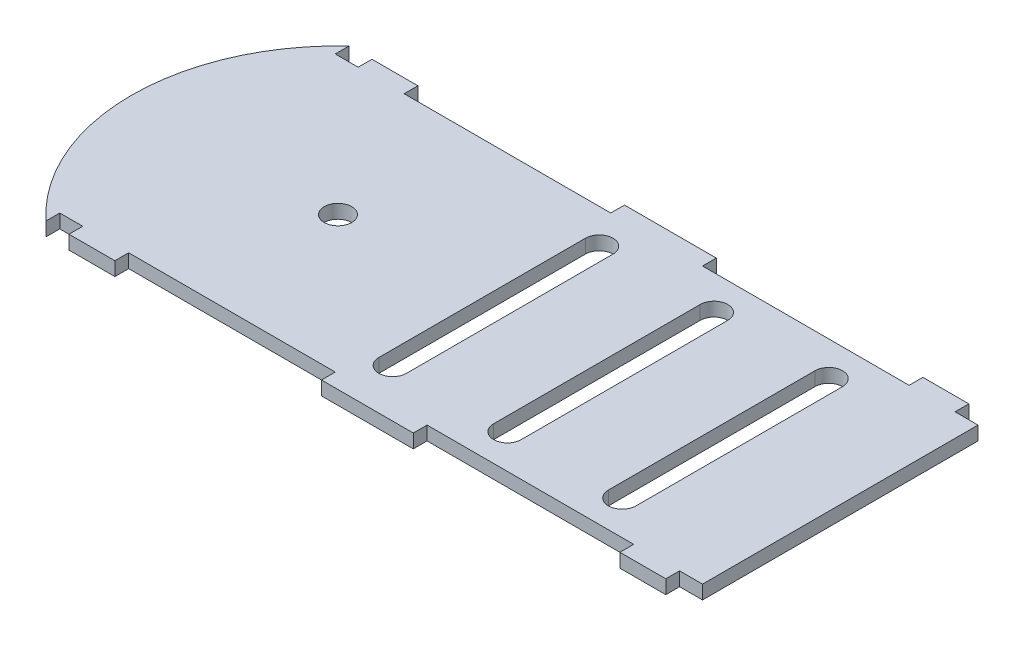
ISO-10303-21;
HEADER;
FILE_DESCRIPTION(('STEP AP214'),'2;1');
FILE_NAME('part.step','',(''),(''),'','','');
FILE_SCHEMA(('AUTOMOTIVE_DESIGN { 1 0 10303 214 1 1 1 1 }'));
ENDSEC;
DATA;
#1=APPLICATION_CONTEXT('core data for automotive mechanical design processes');
#2=APPLICATION_PROTOCOL_DEFINITION('international standard','automotive_design',2000,#1);
#3=PRODUCT_CONTEXT('',#1,'mechanical');
#4=PRODUCT('Part','Part','',(#3));
#5=PRODUCT_RELATED_PRODUCT_CATEGORY('part','',(#4));
#6=PRODUCT_DEFINITION_FORMATION('','',#4);
#7=PRODUCT_DEFINITION_CONTEXT('part definition',#1,'design');
#8=PRODUCT_DEFINITION('design','',#6,#7);
#9=PRODUCT_DEFINITION_SHAPE('','',#8);
#10=(LENGTH_UNIT() NAMED_UNIT(*) SI_UNIT(.MILLI.,.METRE.));
#11=(NAMED_UNIT(*) PLANE_ANGLE_UNIT() SI_UNIT($,.RADIAN.));
#12=(NAMED_UNIT(*) SI_UNIT($,.STERADIAN.) SOLID_ANGLE_UNIT());
#13=UNCERTAINTY_MEASURE_WITH_UNIT(LENGTH_MEASURE(1.E-05),#10,'distance_accuracy_value','');
#14=(GEOMETRIC_REPRESENTATION_CONTEXT(3) GLOBAL_UNCERTAINTY_ASSIGNED_CONTEXT((#13)) GLOBAL_UNIT_ASSIGNED_CONTEXT((#10,
#11,#12)) REPRESENTATION_CONTEXT('',''));
#15=CARTESIAN_POINT('',(0.,0.,0.));
#16=DIRECTION('',(0.,0.,1.));
#17=DIRECTION('',(1.,0.,0.));
#18=AXIS2_PLACEMENT_3D('',#15,#16,#17);
#19=CARTESIAN_POINT('',(-39.4058829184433,3.,0.));
#20=DIRECTION('',(0.,1.,0.));
#21=DIRECTION('',(0.,0.,1.));
#22=AXIS2_PLACEMENT_3D('',#19,#20,#21);
#23=PLANE('',#22);
#24=DIRECTION('',(0.,0.,1.));
#25=VECTOR('',#24,1.);
#26=CARTESIAN_POINT('',(-2.,3.,0.));
#27=LINE('',#26,#25);
#28=CARTESIAN_POINT('',(-2.,3.,-22.4999999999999));
#29=VERTEX_POINT('',#28);
#30=CARTESIAN_POINT('',(-2.,3.,22.5000000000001));
#31=VERTEX_POINT('',#30);
#32=EDGE_CURVE('E341',#29,#31,#27,.T.);
#33=ORIENTED_EDGE('',*,*,#32,.T.);
#34=CARTESIAN_POINT('',(-5.,3.,22.5000000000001));
#35=DIRECTION('',(0.,1.,0.));
#36=DIRECTION('',(0.,0.,1.));
#37=AXIS2_PLACEMENT_3D('',#34,#35,#36);
#38=CIRCLE('',#37,3.);
#39=CARTESIAN_POINT('',(-8.00000000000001,3.,22.5000000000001));
#40=VERTEX_POINT('',#39);
#41=EDGE_CURVE('E304',#31,#40,#38,.F.);
#42=ORIENTED_EDGE('',*,*,#41,.T.);
#43=DIRECTION('',(0.,0.,-1.));
#44=VECTOR('',#43,1.);
#45=CARTESIAN_POINT('',(-8.00000000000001,3.,0.));
#46=LINE('',#45,#44);
#47=CARTESIAN_POINT('',(-8.00000000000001,3.,-22.4999999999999));
#48=VERTEX_POINT('',#47);
#49=EDGE_CURVE('E307',#40,#48,#46,.T.);
#50=ORIENTED_EDGE('',*,*,#49,.T.);
#51=CARTESIAN_POINT('',(-5.,3.,-22.4999999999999));
#52=DIRECTION('',(0.,1.,0.));
#53=DIRECTION('',(0.,0.,1.));
#54=AXIS2_PLACEMENT_3D('',#51,#52,#53);
#55=CIRCLE('',#54,3.);
#56=EDGE_CURVE('E338',#48,#29,#55,.F.);
#57=ORIENTED_EDGE('',*,*,#56,.T.);
#58=EDGE_LOOP('',(#33,#42,#50,#57));
#59=FACE_BOUND('',#58,.T.);
#60=DIRECTION('',(0.,0.,1.));
#61=VECTOR('',#60,1.);
#62=CARTESIAN_POINT('',(48.,3.,0.));
#63=LINE('',#62,#61);
#64=CARTESIAN_POINT('',(48.,3.,-22.5));
#65=VERTEX_POINT('',#64);
#66=CARTESIAN_POINT('',(48.,3.,22.5));
#67=VERTEX_POINT('',#66);
#68=EDGE_CURVE('E404',#65,#67,#63,.T.);
#69=ORIENTED_EDGE('',*,*,#68,.T.);
#70=CARTESIAN_POINT('',(45.,3.,22.5));
#71=DIRECTION('',(0.,1.,0.));
#72=DIRECTION('',(0.,0.,1.));
#73=AXIS2_PLACEMENT_3D('',#70,#71,#72);
#74=CIRCLE('',#73,3.);
#75=CARTESIAN_POINT('',(42.,3.,22.5));
#76=VERTEX_POINT('',#75);
#77=EDGE_CURVE('E407',#67,#76,#74,.F.);
#78=ORIENTED_EDGE('',*,*,#77,.T.);
#79=DIRECTION('',(0.,0.,-1.));
#80=VECTOR('',#79,1.);
#81=CARTESIAN_POINT('',(42.,3.,0.));
#82=LINE('',#81,#80);
#83=CARTESIAN_POINT('',(42.,3.,-22.5));
#84=VERTEX_POINT('',#83);
#85=EDGE_CURVE('E398',#76,#84,#82,.T.);
#86=ORIENTED_EDGE('',*,*,#85,.T.);
#87=CARTESIAN_POINT('',(45.,3.,-22.5));
#88=DIRECTION('',(0.,1.,0.));
#89=DIRECTION('',(0.,0.,1.));
#90=AXIS2_PLACEMENT_3D('',#87,#88,#89);
#91=CIRCLE('',#90,3.);
#92=EDGE_CURVE('E401',#84,#65,#91,.F.);
#93=ORIENTED_EDGE('',*,*,#92,.T.);
#94=EDGE_LOOP('',(#69,#78,#86,#93));
#95=FACE_BOUND('',#94,.T.);
#96=DIRECTION('',(0.,0.,-1.));
#97=VECTOR('',#96,1.);
#98=CARTESIAN_POINT('',(70.,3.,-30.));
#99=LINE('',#98,#97);
#100=CARTESIAN_POINT('',(70.,3.,30.));
#101=VERTEX_POINT('',#100);
#102=CARTESIAN_POINT('',(70.,3.,-30.));
#103=VERTEX_POINT('',#102);
#104=EDGE_CURVE('E577',#101,#103,#99,.T.);
#105=ORIENTED_EDGE('',*,*,#104,.T.);
#106=DIRECTION('',(-1.,0.,0.));
#107=VECTOR('',#106,1.);
#108=CARTESIAN_POINT('',(-70.,3.,-30.));
#109=LINE('',#108,#107);
#110=CARTESIAN_POINT('',(65.,3.,-30.));
#111=VERTEX_POINT('',#110);
#112=EDGE_CURVE('E582',#103,#111,#109,.T.);
#113=ORIENTED_EDGE('',*,*,#112,.T.);
#114=DIRECTION('',(0.,0.,-1.));
#115=VECTOR('',#114,1.);
#116=CARTESIAN_POINT('',(65.,3.,-33.));
#117=LINE('',#116,#115);
#118=CARTESIAN_POINT('',(65.,3.,-33.));
#119=VERTEX_POINT('',#118);
#120=EDGE_CURVE('E521',#111,#119,#117,.T.);
#121=ORIENTED_EDGE('',*,*,#120,.T.);
#122=DIRECTION('',(-1.,0.,0.));
#123=VECTOR('',#122,1.);
#124=CARTESIAN_POINT('',(65.,3.,-33.));
#125=LINE('',#124,#123);
#126=CARTESIAN_POINT('',(55.,3.,-33.));
#127=VERTEX_POINT('',#126);
#128=EDGE_CURVE('E524',#119,#127,#125,.T.);
#129=ORIENTED_EDGE('',*,*,#128,.T.);
#130=DIRECTION('',(0.,0.,1.));
#131=VECTOR('',#130,1.);
#132=CARTESIAN_POINT('',(55.,3.,-33.));
#133=LINE('',#132,#131);
#134=CARTESIAN_POINT('',(55.,3.,-30.));
#135=VERTEX_POINT('',#134);
#136=EDGE_CURVE('E527',#127,#135,#133,.T.);
#137=ORIENTED_EDGE('',*,*,#136,.T.);
#138=CARTESIAN_POINT('',(10.,3.,-30.));
#139=VERTEX_POINT('',#138);
#140=EDGE_CURVE('E586',#135,#139,#109,.T.);
#141=ORIENTED_EDGE('',*,*,#140,.T.);
#142=DIRECTION('',(0.,0.,-1.));
#143=VECTOR('',#142,1.);
#144=CARTESIAN_POINT('',(10.,3.,-33.));
#145=LINE('',#144,#143);
#146=CARTESIAN_POINT('',(10.,3.,-33.));
#147=VERTEX_POINT('',#146);
#148=EDGE_CURVE('E439',#139,#147,#145,.T.);
#149=ORIENTED_EDGE('',*,*,#148,.T.);
#150=DIRECTION('',(-1.,0.,0.));
#151=VECTOR('',#150,1.);
#152=CARTESIAN_POINT('',(-10.,3.,-33.));
#153=LINE('',#152,#151);
#154=CARTESIAN_POINT('',(-10.,3.,-33.));
#155=VERTEX_POINT('',#154);
#156=EDGE_CURVE('E442',#147,#155,#153,.T.);
#157=ORIENTED_EDGE('',*,*,#156,.T.);
#158=DIRECTION('',(0.,0.,1.));
#159=VECTOR('',#158,1.);
#160=CARTESIAN_POINT('',(-10.,3.,-33.));
#161=LINE('',#160,#159);
#162=CARTESIAN_POINT('',(-9.99999999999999,3.,-30.));
#163=VERTEX_POINT('',#162);
#164=EDGE_CURVE('E445',#155,#163,#161,.T.);
#165=ORIENTED_EDGE('',*,*,#164,.T.);
#166=CARTESIAN_POINT('',(-55.,3.,-30.));
#167=VERTEX_POINT('',#166);
#168=EDGE_CURVE('E587',#163,#167,#109,.T.);
#169=ORIENTED_EDGE('',*,*,#168,.T.);
#170=DIRECTION('',(0.,0.,-1.));
#171=VECTOR('',#170,1.);
#172=CARTESIAN_POINT('',(-55.,3.,-33.));
#173=LINE('',#172,#171);
#174=CARTESIAN_POINT('',(-55.,3.,-33.));
#175=VERTEX_POINT('',#174);
#176=EDGE_CURVE('E549',#167,#175,#173,.T.);
#177=ORIENTED_EDGE('',*,*,#176,.T.);
#178=DIRECTION('',(-1.,0.,0.));
#179=VECTOR('',#178,1.);
#180=CARTESIAN_POINT('',(-65.,3.,-33.));
#181=LINE('',#180,#179);
#182=CARTESIAN_POINT('',(-65.,3.,-33.));
#183=VERTEX_POINT('',#182);
#184=EDGE_CURVE('E552',#175,#183,#181,.T.);
#185=ORIENTED_EDGE('',*,*,#184,.T.);
#186=DIRECTION('',(0.,0.,1.));
#187=VECTOR('',#186,1.);
#188=CARTESIAN_POINT('',(-65.,3.,-33.));
#189=LINE('',#188,#187);
#190=CARTESIAN_POINT('',(-65.,3.,-30.));
#191=VERTEX_POINT('',#190);
#192=EDGE_CURVE('E555',#183,#191,#189,.T.);
#193=ORIENTED_EDGE('',*,*,#192,.T.);
#194=CARTESIAN_POINT('',(-70.,3.,-30.));
#195=VERTEX_POINT('',#194);
#196=EDGE_CURVE('E580',#191,#195,#109,.T.);
#197=ORIENTED_EDGE('',*,*,#196,.T.);
#198=DIRECTION('',(0.,0.,-1.));
#199=VECTOR('',#198,1.);
#200=CARTESIAN_POINT('',(-70.,3.,-33.));
#201=LINE('',#200,#199);
#202=CARTESIAN_POINT('',(-70.,3.,-33.));
#203=VERTEX_POINT('',#202);
#204=EDGE_CURVE('E585',#195,#203,#201,.T.);
#205=ORIENTED_EDGE('',*,*,#204,.T.);
#206=CARTESIAN_POINT('',(-39.4058829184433,3.,0.));
#207=DIRECTION('',(0.,1.,0.));
#208=DIRECTION('',(0.,0.,1.));
#209=AXIS2_PLACEMENT_3D('',#206,#207,#208);
#210=CIRCLE('',#209,45.);
#211=CARTESIAN_POINT('',(-70.,3.,33.));
#212=VERTEX_POINT('',#211);
#213=EDGE_CURVE('E589',#203,#212,#210,.T.);
#214=ORIENTED_EDGE('',*,*,#213,.T.);
#215=DIRECTION('',(0.,0.,-1.));
#216=VECTOR('',#215,1.);
#217=CARTESIAN_POINT('',(-70.,3.,30.));
#218=LINE('',#217,#216);
#219=CARTESIAN_POINT('',(-70.,3.,30.));
#220=VERTEX_POINT('',#219);
#221=EDGE_CURVE('E591',#212,#220,#218,.T.);
#222=ORIENTED_EDGE('',*,*,#221,.T.);
#223=DIRECTION('',(1.,0.,0.));
#224=VECTOR('',#223,1.);
#225=CARTESIAN_POINT('',(-70.,3.,30.));
#226=LINE('',#225,#224);
#227=CARTESIAN_POINT('',(-65.,3.,30.));
#228=VERTEX_POINT('',#227);
#229=EDGE_CURVE('E594',#220,#228,#226,.T.);
#230=ORIENTED_EDGE('',*,*,#229,.T.);
#231=DIRECTION('',(0.,0.,1.));
#232=VECTOR('',#231,1.);
#233=CARTESIAN_POINT('',(-65.,3.,33.));
#234=LINE('',#233,#232);
#235=CARTESIAN_POINT('',(-65.,3.,33.));
#236=VERTEX_POINT('',#235);
#237=EDGE_CURVE('E467',#228,#236,#234,.T.);
#238=ORIENTED_EDGE('',*,*,#237,.T.);
#239=DIRECTION('',(1.,0.,0.));
#240=VECTOR('',#239,1.);
#241=CARTESIAN_POINT('',(-65.,3.,33.));
#242=LINE('',#241,#240);
#243=CARTESIAN_POINT('',(-55.,3.,33.));
#244=VERTEX_POINT('',#243);
#245=EDGE_CURVE('E470',#236,#244,#242,.T.);
#246=ORIENTED_EDGE('',*,*,#245,.T.);
#247=DIRECTION('',(0.,0.,-1.));
#248=VECTOR('',#247,1.);
#249=CARTESIAN_POINT('',(-55.,3.,33.));
#250=LINE('',#249,#248);
#251=CARTESIAN_POINT('',(-55.,3.,30.));
#252=VERTEX_POINT('',#251);
#253=EDGE_CURVE('E473',#244,#252,#250,.T.);
#254=ORIENTED_EDGE('',*,*,#253,.T.);
#255=CARTESIAN_POINT('',(-9.99999999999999,3.,30.));
#256=VERTEX_POINT('',#255);
#257=EDGE_CURVE('E598',#252,#256,#226,.T.);
#258=ORIENTED_EDGE('',*,*,#257,.T.);
#259=DIRECTION('',(0.,0.,1.));
#260=VECTOR('',#259,1.);
#261=CARTESIAN_POINT('',(-10.,3.,33.));
#262=LINE('',#261,#260);
#263=CARTESIAN_POINT('',(-10.,3.,33.));
#264=VERTEX_POINT('',#263);
#265=EDGE_CURVE('E411',#256,#264,#262,.T.);
#266=ORIENTED_EDGE('',*,*,#265,.T.);
#267=DIRECTION('',(1.,0.,0.));
#268=VECTOR('',#267,1.);
#269=CARTESIAN_POINT('',(-10.,3.,33.));
#270=LINE('',#269,#268);
#271=CARTESIAN_POINT('',(10.,3.,33.));
#272=VERTEX_POINT('',#271);
#273=EDGE_CURVE('E414',#264,#272,#270,.T.);
#274=ORIENTED_EDGE('',*,*,#273,.T.);
#275=DIRECTION('',(0.,0.,-1.));
#276=VECTOR('',#275,1.);
#277=CARTESIAN_POINT('',(10.,3.,33.));
#278=LINE('',#277,#276);
#279=CARTESIAN_POINT('',(10.,3.,30.));
#280=VERTEX_POINT('',#279);
#281=EDGE_CURVE('E417',#272,#280,#278,.T.);
#282=ORIENTED_EDGE('',*,*,#281,.T.);
#283=CARTESIAN_POINT('',(55.,3.,30.));
#284=VERTEX_POINT('',#283);
#285=EDGE_CURVE('E599',#280,#284,#226,.T.);
#286=ORIENTED_EDGE('',*,*,#285,.T.);
#287=DIRECTION('',(0.,0.,1.));
#288=VECTOR('',#287,1.);
#289=CARTESIAN_POINT('',(55.,3.,33.));
#290=LINE('',#289,#288);
#291=CARTESIAN_POINT('',(55.,3.,33.));
#292=VERTEX_POINT('',#291);
#293=EDGE_CURVE('E498',#284,#292,#290,.T.);
#294=ORIENTED_EDGE('',*,*,#293,.T.);
#295=DIRECTION('',(1.,0.,0.));
#296=VECTOR('',#295,1.);
#297=CARTESIAN_POINT('',(65.,3.,33.));
#298=LINE('',#297,#296);
#299=CARTESIAN_POINT('',(65.,3.,33.));
#300=VERTEX_POINT('',#299);
#301=EDGE_CURVE('E501',#292,#300,#298,.T.);
#302=ORIENTED_EDGE('',*,*,#301,.T.);
#303=DIRECTION('',(0.,0.,-1.));
#304=VECTOR('',#303,1.);
#305=CARTESIAN_POINT('',(65.,3.,33.));
#306=LINE('',#305,#304);
#307=CARTESIAN_POINT('',(65.,3.,30.));
#308=VERTEX_POINT('',#307);
#309=EDGE_CURVE('E495',#300,#308,#306,.T.);
#310=ORIENTED_EDGE('',*,*,#309,.T.);
#311=EDGE_CURVE('E593',#308,#101,#226,.T.);
#312=ORIENTED_EDGE('',*,*,#311,.T.);
#313=EDGE_LOOP('',(#105,#113,#121,#129,#137,#141,#149,#157,#165,#169,#177,#185,#193,#197,#205,
#214,#222,#230,#238,#246,#254,#258,#266,#274,#282,#286,#294,#302,#310,#312));
#314=FACE_BOUND('',#313,.T.);
#315=DIRECTION('',(0.,0.,1.));
#316=VECTOR('',#315,1.);
#317=CARTESIAN_POINT('',(23.,3.,0.));
#318=LINE('',#317,#316);
#319=CARTESIAN_POINT('',(23.,3.,-22.5));
#320=VERTEX_POINT('',#319);
#321=CARTESIAN_POINT('',(23.,3.,22.5));
#322=VERTEX_POINT('',#321);
#323=EDGE_CURVE('E371',#320,#322,#318,.T.);
#324=ORIENTED_EDGE('',*,*,#323,.T.);
#325=CARTESIAN_POINT('',(20.,3.,22.5));
#326=DIRECTION('',(0.,1.,0.));
#327=DIRECTION('',(0.,0.,1.));
#328=AXIS2_PLACEMENT_3D('',#325,#326,#327);
#329=CIRCLE('',#328,3.);
#330=CARTESIAN_POINT('',(17.,3.,22.5));
#331=VERTEX_POINT('',#330);
#332=EDGE_CURVE('E374',#322,#331,#329,.F.);
#333=ORIENTED_EDGE('',*,*,#332,.T.);
#334=DIRECTION('',(0.,0.,-1.));
#335=VECTOR('',#334,1.);
#336=CARTESIAN_POINT('',(17.,3.,0.));
#337=LINE('',#336,#335);
#338=CARTESIAN_POINT('',(17.,3.,-22.5));
#339=VERTEX_POINT('',#338);
#340=EDGE_CURVE('E365',#331,#339,#337,.T.);
#341=ORIENTED_EDGE('',*,*,#340,.T.);
#342=CARTESIAN_POINT('',(20.,3.,-22.5));
#343=DIRECTION('',(0.,1.,0.));
#344=DIRECTION('',(0.,0.,1.));
#345=AXIS2_PLACEMENT_3D('',#342,#343,#344);
#346=CIRCLE('',#345,3.);
#347=EDGE_CURVE('E368',#339,#320,#346,.F.);
#348=ORIENTED_EDGE('',*,*,#347,.T.);
#349=EDGE_LOOP('',(#324,#333,#341,#348));
#350=FACE_BOUND('',#349,.T.);
#351=CARTESIAN_POINT('',(-39.4058829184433,3.,0.));
#352=DIRECTION('',(0.,1.,0.));
#353=DIRECTION('',(0.,0.,1.));
#354=AXIS2_PLACEMENT_3D('',#351,#352,#353);
#355=CIRCLE('',#354,3.);
#356=CARTESIAN_POINT('',(-39.4058829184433,3.,2.99999999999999));
#357=VERTEX_POINT('',#356);
#358=EDGE_CURVE('E323',#357,#357,#355,.F.);
#359=ORIENTED_EDGE('',*,*,#358,.T.);
#360=EDGE_LOOP('',(#359));
#361=FACE_BOUND('',#360,.T.);
#362=ADVANCED_FACE('F32',(#59,#95,#314,#350,#361),#23,.T.);
#363=CARTESIAN_POINT('',(-39.4058829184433,0.,0.));
#364=DIRECTION('',(0.,1.,0.));
#365=DIRECTION('',(0.,0.,1.));
#366=AXIS2_PLACEMENT_3D('',#363,#364,#365);
#367=PLANE('',#366);
#368=CARTESIAN_POINT('',(-5.,0.,22.5000000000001));
#369=DIRECTION('',(0.,1.,0.));
#370=DIRECTION('',(0.,0.,1.));
#371=AXIS2_PLACEMENT_3D('',#368,#369,#370);
#372=CIRCLE('',#371,3.);
#373=CARTESIAN_POINT('',(-8.00000000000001,0.,22.5000000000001));
#374=VERTEX_POINT('',#373);
#375=CARTESIAN_POINT('',(-2.,0.,22.5000000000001));
#376=VERTEX_POINT('',#375);
#377=EDGE_CURVE('E55',#374,#376,#372,.T.);
#378=ORIENTED_EDGE('',*,*,#377,.T.);
#379=DIRECTION('',(0.,0.,-1.));
#380=VECTOR('',#379,1.);
#381=CARTESIAN_POINT('',(-2.,0.,22.5000000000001));
#382=LINE('',#381,#380);
#383=CARTESIAN_POINT('',(-2.,0.,-22.4999999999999));
#384=VERTEX_POINT('',#383);
#385=EDGE_CURVE('E311',#376,#384,#382,.T.);
#386=ORIENTED_EDGE('',*,*,#385,.T.);
#387=CARTESIAN_POINT('',(-5.,0.,-22.4999999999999));
#388=DIRECTION('',(0.,1.,0.));
#389=DIRECTION('',(0.,0.,1.));
#390=AXIS2_PLACEMENT_3D('',#387,#388,#389);
#391=CIRCLE('',#390,3.);
#392=CARTESIAN_POINT('',(-8.00000000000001,0.,-22.4999999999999));
#393=VERTEX_POINT('',#392);
#394=EDGE_CURVE('E317',#384,#393,#391,.T.);
#395=ORIENTED_EDGE('',*,*,#394,.T.);
#396=DIRECTION('',(0.,0.,1.));
#397=VECTOR('',#396,1.);
#398=CARTESIAN_POINT('',(-8.00000000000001,0.,22.5000000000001));
#399=LINE('',#398,#397);
#400=EDGE_CURVE('E322',#393,#374,#399,.T.);
#401=ORIENTED_EDGE('',*,*,#400,.T.);
#402=EDGE_LOOP('',(#378,#386,#395,#401));
#403=FACE_BOUND('',#402,.T.);
#404=CARTESIAN_POINT('',(45.,0.,22.5));
#405=DIRECTION('',(0.,1.,0.));
#406=DIRECTION('',(0.,0.,1.));
#407=AXIS2_PLACEMENT_3D('',#404,#405,#406);
#408=CIRCLE('',#407,3.);
#409=CARTESIAN_POINT('',(42.,0.,22.5));
#410=VERTEX_POINT('',#409);
#411=CARTESIAN_POINT('',(48.,0.,22.5));
#412=VERTEX_POINT('',#411);
#413=EDGE_CURVE('E377',#410,#412,#408,.T.);
#414=ORIENTED_EDGE('',*,*,#413,.T.);
#415=DIRECTION('',(0.,0.,-1.));
#416=VECTOR('',#415,1.);
#417=CARTESIAN_POINT('',(48.,0.,22.5));
#418=LINE('',#417,#416);
#419=CARTESIAN_POINT('',(48.,0.,-22.5));
#420=VERTEX_POINT('',#419);
#421=EDGE_CURVE('E380',#412,#420,#418,.T.);
#422=ORIENTED_EDGE('',*,*,#421,.T.);
#423=CARTESIAN_POINT('',(45.,0.,-22.5));
#424=DIRECTION('',(0.,1.,0.));
#425=DIRECTION('',(0.,0.,1.));
#426=AXIS2_PLACEMENT_3D('',#423,#424,#425);
#427=CIRCLE('',#426,3.);
#428=CARTESIAN_POINT('',(42.,0.,-22.5));
#429=VERTEX_POINT('',#428);
#430=EDGE_CURVE('E383',#420,#429,#427,.T.);
#431=ORIENTED_EDGE('',*,*,#430,.T.);
#432=DIRECTION('',(0.,0.,1.));
#433=VECTOR('',#432,1.);
#434=CARTESIAN_POINT('',(42.,0.,22.5));
#435=LINE('',#434,#433);
#436=EDGE_CURVE('E386',#429,#410,#435,.T.);
#437=ORIENTED_EDGE('',*,*,#436,.T.);
#438=EDGE_LOOP('',(#414,#422,#431,#437));
#439=FACE_BOUND('',#438,.T.);
#440=DIRECTION('',(0.,0.,-1.));
#441=VECTOR('',#440,1.);
#442=CARTESIAN_POINT('',(70.,0.,-30.));
#443=LINE('',#442,#441);
#444=CARTESIAN_POINT('',(70.,0.,30.));
#445=VERTEX_POINT('',#444);
#446=CARTESIAN_POINT('',(70.,0.,-30.));
#447=VERTEX_POINT('',#446);
#448=EDGE_CURVE('E576',#445,#447,#443,.T.);
#449=ORIENTED_EDGE('',*,*,#448,.F.);
#450=DIRECTION('',(1.,0.,0.));
#451=VECTOR('',#450,1.);
#452=CARTESIAN_POINT('',(-70.,0.,30.));
#453=LINE('',#452,#451);
#454=CARTESIAN_POINT('',(65.,0.,30.));
#455=VERTEX_POINT('',#454);
#456=EDGE_CURVE('E613',#455,#445,#453,.T.);
#457=ORIENTED_EDGE('',*,*,#456,.F.);
#458=DIRECTION('',(0.,0.,-1.));
#459=VECTOR('',#458,1.);
#460=CARTESIAN_POINT('',(65.,0.,33.));
#461=LINE('',#460,#459);
#462=CARTESIAN_POINT('',(65.,0.,33.));
#463=VERTEX_POINT('',#462);
#464=EDGE_CURVE('E494',#463,#455,#461,.T.);
#465=ORIENTED_EDGE('',*,*,#464,.F.);
#466=DIRECTION('',(1.,0.,0.));
#467=VECTOR('',#466,1.);
#468=CARTESIAN_POINT('',(65.,0.,33.));
#469=LINE('',#468,#467);
#470=CARTESIAN_POINT('',(55.,0.,33.));
#471=VERTEX_POINT('',#470);
#472=EDGE_CURVE('E499',#471,#463,#469,.T.);
#473=ORIENTED_EDGE('',*,*,#472,.F.);
#474=DIRECTION('',(0.,0.,1.));
#475=VECTOR('',#474,1.);
#476=CARTESIAN_POINT('',(55.,0.,33.));
#477=LINE('',#476,#475);
#478=CARTESIAN_POINT('',(55.,0.,30.));
#479=VERTEX_POINT('',#478);
#480=EDGE_CURVE('E506',#479,#471,#477,.T.);
#481=ORIENTED_EDGE('',*,*,#480,.F.);
#482=CARTESIAN_POINT('',(10.,0.,30.));
#483=VERTEX_POINT('',#482);
#484=EDGE_CURVE('E616',#483,#479,#453,.T.);
#485=ORIENTED_EDGE('',*,*,#484,.F.);
#486=DIRECTION('',(0.,0.,-1.));
#487=VECTOR('',#486,1.);
#488=CARTESIAN_POINT('',(10.,0.,33.));
#489=LINE('',#488,#487);
#490=CARTESIAN_POINT('',(10.,0.,33.));
#491=VERTEX_POINT('',#490);
#492=EDGE_CURVE('E415',#491,#483,#489,.T.);
#493=ORIENTED_EDGE('',*,*,#492,.F.);
#494=DIRECTION('',(1.,0.,0.));
#495=VECTOR('',#494,1.);
#496=CARTESIAN_POINT('',(-10.,0.,33.));
#497=LINE('',#496,#495);
#498=CARTESIAN_POINT('',(-10.,0.,33.));
#499=VERTEX_POINT('',#498);
#500=EDGE_CURVE('E423',#499,#491,#497,.T.);
#501=ORIENTED_EDGE('',*,*,#500,.F.);
#502=DIRECTION('',(0.,0.,1.));
#503=VECTOR('',#502,1.);
#504=CARTESIAN_POINT('',(-10.,0.,33.));
#505=LINE('',#504,#503);
#506=CARTESIAN_POINT('',(-9.99999999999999,0.,30.));
#507=VERTEX_POINT('',#506);
#508=EDGE_CURVE('E410',#507,#499,#505,.T.);
#509=ORIENTED_EDGE('',*,*,#508,.F.);
#510=CARTESIAN_POINT('',(-55.,0.,30.));
#511=VERTEX_POINT('',#510);
#512=EDGE_CURVE('E615',#511,#507,#453,.T.);
#513=ORIENTED_EDGE('',*,*,#512,.F.);
#514=DIRECTION('',(0.,0.,-1.));
#515=VECTOR('',#514,1.);
#516=CARTESIAN_POINT('',(-55.,0.,33.));
#517=LINE('',#516,#515);
#518=CARTESIAN_POINT('',(-55.,0.,33.));
#519=VERTEX_POINT('',#518);
#520=EDGE_CURVE('E471',#519,#511,#517,.T.);
#521=ORIENTED_EDGE('',*,*,#520,.F.);
#522=DIRECTION('',(1.,0.,0.));
#523=VECTOR('',#522,1.);
#524=CARTESIAN_POINT('',(-65.,0.,33.));
#525=LINE('',#524,#523);
#526=CARTESIAN_POINT('',(-65.,0.,33.));
#527=VERTEX_POINT('',#526);
#528=EDGE_CURVE('E479',#527,#519,#525,.T.);
#529=ORIENTED_EDGE('',*,*,#528,.F.);
#530=DIRECTION('',(0.,0.,1.));
#531=VECTOR('',#530,1.);
#532=CARTESIAN_POINT('',(-65.,0.,33.));
#533=LINE('',#532,#531);
#534=CARTESIAN_POINT('',(-65.,0.,30.));
#535=VERTEX_POINT('',#534);
#536=EDGE_CURVE('E466',#535,#527,#533,.T.);
#537=ORIENTED_EDGE('',*,*,#536,.F.);
#538=CARTESIAN_POINT('',(-70.,0.,30.));
#539=VERTEX_POINT('',#538);
#540=EDGE_CURVE('E581',#539,#535,#453,.T.);
#541=ORIENTED_EDGE('',*,*,#540,.F.);
#542=DIRECTION('',(0.,0.,-1.));
#543=VECTOR('',#542,1.);
#544=CARTESIAN_POINT('',(-70.,0.,30.));
#545=LINE('',#544,#543);
#546=CARTESIAN_POINT('',(-70.,0.,33.));
#547=VERTEX_POINT('',#546);
#548=EDGE_CURVE('E611',#547,#539,#545,.T.);
#549=ORIENTED_EDGE('',*,*,#548,.F.);
#550=CARTESIAN_POINT('',(-39.4058829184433,0.,0.));
#551=DIRECTION('',(0.,1.,0.));
#552=DIRECTION('',(0.,0.,1.));
#553=AXIS2_PLACEMENT_3D('',#550,#551,#552);
#554=CIRCLE('',#553,45.);
#555=CARTESIAN_POINT('',(-70.,0.,-33.));
#556=VERTEX_POINT('',#555);
#557=EDGE_CURVE('E609',#556,#547,#554,.T.);
#558=ORIENTED_EDGE('',*,*,#557,.F.);
#559=DIRECTION('',(0.,0.,-1.));
#560=VECTOR('',#559,1.);
#561=CARTESIAN_POINT('',(-70.,0.,-33.));
#562=LINE('',#561,#560);
#563=CARTESIAN_POINT('',(-70.,0.,-30.));
#564=VERTEX_POINT('',#563);
#565=EDGE_CURVE('E605',#564,#556,#562,.T.);
#566=ORIENTED_EDGE('',*,*,#565,.F.);
#567=DIRECTION('',(-1.,0.,0.));
#568=VECTOR('',#567,1.);
#569=CARTESIAN_POINT('',(-70.,0.,-30.));
#570=LINE('',#569,#568);
#571=CARTESIAN_POINT('',(-65.,0.,-30.));
#572=VERTEX_POINT('',#571);
#573=EDGE_CURVE('E602',#572,#564,#570,.T.);
#574=ORIENTED_EDGE('',*,*,#573,.F.);
#575=DIRECTION('',(0.,0.,1.));
#576=VECTOR('',#575,1.);
#577=CARTESIAN_POINT('',(-65.,0.,-33.));
#578=LINE('',#577,#576);
#579=CARTESIAN_POINT('',(-65.,0.,-33.));
#580=VERTEX_POINT('',#579);
#581=EDGE_CURVE('E553',#580,#572,#578,.T.);
#582=ORIENTED_EDGE('',*,*,#581,.F.);
#583=DIRECTION('',(-1.,0.,0.));
#584=VECTOR('',#583,1.);
#585=CARTESIAN_POINT('',(-65.,0.,-33.));
#586=LINE('',#585,#584);
#587=CARTESIAN_POINT('',(-55.,0.,-33.));
#588=VERTEX_POINT('',#587);
#589=EDGE_CURVE('E561',#588,#580,#586,.T.);
#590=ORIENTED_EDGE('',*,*,#589,.F.);
#591=DIRECTION('',(0.,0.,-1.));
#592=VECTOR('',#591,1.);
#593=CARTESIAN_POINT('',(-55.,0.,-33.));
#594=LINE('',#593,#592);
#595=CARTESIAN_POINT('',(-55.,0.,-30.));
#596=VERTEX_POINT('',#595);
#597=EDGE_CURVE('E548',#596,#588,#594,.T.);
#598=ORIENTED_EDGE('',*,*,#597,.F.);
#599=CARTESIAN_POINT('',(-10.,0.,-30.));
#600=VERTEX_POINT('',#599);
#601=EDGE_CURVE('E607',#600,#596,#570,.T.);
#602=ORIENTED_EDGE('',*,*,#601,.F.);
#603=DIRECTION('',(0.,0.,1.));
#604=VECTOR('',#603,1.);
#605=CARTESIAN_POINT('',(-10.,0.,-33.));
#606=LINE('',#605,#604);
#607=CARTESIAN_POINT('',(-10.,0.,-33.));
#608=VERTEX_POINT('',#607);
#609=EDGE_CURVE('E443',#608,#600,#606,.T.);
#610=ORIENTED_EDGE('',*,*,#609,.F.);
#611=DIRECTION('',(-1.,0.,0.));
#612=VECTOR('',#611,1.);
#613=CARTESIAN_POINT('',(-10.,0.,-33.));
#614=LINE('',#613,#612);
#615=CARTESIAN_POINT('',(10.,0.,-33.));
#616=VERTEX_POINT('',#615);
#617=EDGE_CURVE('E451',#616,#608,#614,.T.);
#618=ORIENTED_EDGE('',*,*,#617,.F.);
#619=DIRECTION('',(0.,0.,-1.));
#620=VECTOR('',#619,1.);
#621=CARTESIAN_POINT('',(10.,0.,-33.));
#622=LINE('',#621,#620);
#623=CARTESIAN_POINT('',(10.,0.,-30.));
#624=VERTEX_POINT('',#623);
#625=EDGE_CURVE('E438',#624,#616,#622,.T.);
#626=ORIENTED_EDGE('',*,*,#625,.F.);
#627=CARTESIAN_POINT('',(55.,0.,-30.));
#628=VERTEX_POINT('',#627);
#629=EDGE_CURVE('E606',#628,#624,#570,.T.);
#630=ORIENTED_EDGE('',*,*,#629,.F.);
#631=DIRECTION('',(0.,0.,1.));
#632=VECTOR('',#631,1.);
#633=CARTESIAN_POINT('',(55.,0.,-33.));
#634=LINE('',#633,#632);
#635=CARTESIAN_POINT('',(55.,0.,-33.));
#636=VERTEX_POINT('',#635);
#637=EDGE_CURVE('E525',#636,#628,#634,.T.);
#638=ORIENTED_EDGE('',*,*,#637,.F.);
#639=DIRECTION('',(-1.,0.,0.));
#640=VECTOR('',#639,1.);
#641=CARTESIAN_POINT('',(65.,0.,-33.));
#642=LINE('',#641,#640);
#643=CARTESIAN_POINT('',(65.,0.,-33.));
#644=VERTEX_POINT('',#643);
#645=EDGE_CURVE('E533',#644,#636,#642,.T.);
#646=ORIENTED_EDGE('',*,*,#645,.F.);
#647=DIRECTION('',(0.,0.,-1.));
#648=VECTOR('',#647,1.);
#649=CARTESIAN_POINT('',(65.,0.,-33.));
#650=LINE('',#649,#648);
#651=CARTESIAN_POINT('',(65.,0.,-30.));
#652=VERTEX_POINT('',#651);
#653=EDGE_CURVE('E520',#652,#644,#650,.T.);
#654=ORIENTED_EDGE('',*,*,#653,.F.);
#655=EDGE_CURVE('E603',#447,#652,#570,.T.);
#656=ORIENTED_EDGE('',*,*,#655,.F.);
#657=EDGE_LOOP('',(#449,#457,#465,#473,#481,#485,#493,#501,#509,#513,#521,#529,#537,#541,#549,
#558,#566,#574,#582,#590,#598,#602,#610,#618,#626,#630,#638,#646,#654,#656));
#658=FACE_BOUND('',#657,.T.);
#659=CARTESIAN_POINT('',(20.,0.,22.5));
#660=DIRECTION('',(0.,1.,0.));
#661=DIRECTION('',(0.,0.,1.));
#662=AXIS2_PLACEMENT_3D('',#659,#660,#661);
#663=CIRCLE('',#662,3.);
#664=CARTESIAN_POINT('',(17.,0.,22.5));
#665=VERTEX_POINT('',#664);
#666=CARTESIAN_POINT('',(23.,0.,22.5));
#667=VERTEX_POINT('',#666);
#668=EDGE_CURVE('E344',#665,#667,#663,.T.);
#669=ORIENTED_EDGE('',*,*,#668,.T.);
#670=DIRECTION('',(0.,0.,-1.));
#671=VECTOR('',#670,1.);
#672=CARTESIAN_POINT('',(23.,0.,22.5));
#673=LINE('',#672,#671);
#674=CARTESIAN_POINT('',(23.,0.,-22.5));
#675=VERTEX_POINT('',#674);
#676=EDGE_CURVE('E347',#667,#675,#673,.T.);
#677=ORIENTED_EDGE('',*,*,#676,.T.);
#678=CARTESIAN_POINT('',(20.,0.,-22.5));
#679=DIRECTION('',(0.,1.,0.));
#680=DIRECTION('',(0.,0.,1.));
#681=AXIS2_PLACEMENT_3D('',#678,#679,#680);
#682=CIRCLE('',#681,3.);
#683=CARTESIAN_POINT('',(17.,0.,-22.5));
#684=VERTEX_POINT('',#683);
#685=EDGE_CURVE('E350',#675,#684,#682,.T.);
#686=ORIENTED_EDGE('',*,*,#685,.T.);
#687=DIRECTION('',(0.,0.,1.));
#688=VECTOR('',#687,1.);
#689=CARTESIAN_POINT('',(17.,0.,22.5));
#690=LINE('',#689,#688);
#691=EDGE_CURVE('E353',#684,#665,#690,.T.);
#692=ORIENTED_EDGE('',*,*,#691,.T.);
#693=EDGE_LOOP('',(#669,#677,#686,#692));
#694=FACE_BOUND('',#693,.T.);
#695=CARTESIAN_POINT('',(-39.4058829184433,0.,0.));
#696=DIRECTION('',(0.,1.,0.));
#697=DIRECTION('',(0.,0.,1.));
#698=AXIS2_PLACEMENT_3D('',#695,#696,#697);
#699=CIRCLE('',#698,3.);
#700=CARTESIAN_POINT('',(-39.4058829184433,0.,2.99999999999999));
#701=VERTEX_POINT('',#700);
#702=EDGE_CURVE('E326',#701,#701,#699,.T.);
#703=ORIENTED_EDGE('',*,*,#702,.T.);
#704=EDGE_LOOP('',(#703));
#705=FACE_BOUND('',#704,.T.);
#706=ADVANCED_FACE('F320',(#403,#439,#658,#694,#705),#367,.F.);
#707=CARTESIAN_POINT('',(-70.,3.,30.));
#708=DIRECTION('',(0.,0.,-1.));
#709=DIRECTION('',(-1.,0.,0.));
#710=AXIS2_PLACEMENT_3D('',#707,#708,#709);
#711=PLANE('',#710);
#712=DIRECTION('',(0.,-1.,0.));
#713=VECTOR('',#712,1.);
#714=CARTESIAN_POINT('',(-10.,3.,30.));
#715=LINE('',#714,#713);
#716=EDGE_CURVE('E420',#256,#507,#715,.T.);
#717=ORIENTED_EDGE('',*,*,#716,.F.);
#718=ORIENTED_EDGE('',*,*,#257,.F.);
#719=DIRECTION('',(0.,-1.,0.));
#720=VECTOR('',#719,1.);
#721=CARTESIAN_POINT('',(-55.,3.,30.));
#722=LINE('',#721,#720);
#723=EDGE_CURVE('E485',#252,#511,#722,.T.);
#724=ORIENTED_EDGE('',*,*,#723,.T.);
#725=ORIENTED_EDGE('',*,*,#512,.T.);
#726=EDGE_LOOP('',(#717,#718,#724,#725));
#727=FACE_BOUND('',#726,.T.);
#728=ADVANCED_FACE('F710',(#727),#711,.F.);
#729=DIRECTION('',(0.,-1.,0.));
#730=VECTOR('',#729,1.);
#731=CARTESIAN_POINT('',(10.,3.,30.));
#732=LINE('',#731,#730);
#733=EDGE_CURVE('E429',#280,#483,#732,.T.);
#734=ORIENTED_EDGE('',*,*,#733,.T.);
#735=ORIENTED_EDGE('',*,*,#484,.T.);
#736=DIRECTION('',(0.,-1.,0.));
#737=VECTOR('',#736,1.);
#738=CARTESIAN_POINT('',(55.,3.,30.));
#739=LINE('',#738,#737);
#740=EDGE_CURVE('E514',#284,#479,#739,.T.);
#741=ORIENTED_EDGE('',*,*,#740,.F.);
#742=ORIENTED_EDGE('',*,*,#285,.F.);
#743=EDGE_LOOP('',(#734,#735,#741,#742));
#744=FACE_BOUND('',#743,.T.);
#745=ADVANCED_FACE('F740',(#744),#711,.F.);
#746=CARTESIAN_POINT('',(-70.,3.,-30.));
#747=DIRECTION('',(0.,0.,1.));
#748=DIRECTION('',(1.,0.,0.));
#749=AXIS2_PLACEMENT_3D('',#746,#747,#748);
#750=PLANE('',#749);
#751=DIRECTION('',(0.,-1.,0.));
#752=VECTOR('',#751,1.);
#753=CARTESIAN_POINT('',(10.,3.,-30.));
#754=LINE('',#753,#752);
#755=EDGE_CURVE('E448',#139,#624,#754,.T.);
#756=ORIENTED_EDGE('',*,*,#755,.F.);
#757=ORIENTED_EDGE('',*,*,#140,.F.);
#758=DIRECTION('',(0.,-1.,0.));
#759=VECTOR('',#758,1.);
#760=CARTESIAN_POINT('',(55.,3.,-30.));
#761=LINE('',#760,#759);
#762=EDGE_CURVE('E539',#135,#628,#761,.T.);
#763=ORIENTED_EDGE('',*,*,#762,.T.);
#764=ORIENTED_EDGE('',*,*,#629,.T.);
#765=EDGE_LOOP('',(#756,#757,#763,#764));
#766=FACE_BOUND('',#765,.T.);
#767=ADVANCED_FACE('F687',(#766),#750,.F.);
#768=DIRECTION('',(0.,-1.,0.));
#769=VECTOR('',#768,1.);
#770=CARTESIAN_POINT('',(-10.,3.,-30.));
#771=LINE('',#770,#769);
#772=EDGE_CURVE('E457',#163,#600,#771,.T.);
#773=ORIENTED_EDGE('',*,*,#772,.T.);
#774=ORIENTED_EDGE('',*,*,#601,.T.);
#775=DIRECTION('',(0.,-1.,0.));
#776=VECTOR('',#775,1.);
#777=CARTESIAN_POINT('',(-55.,3.,-30.));
#778=LINE('',#777,#776);
#779=EDGE_CURVE('E558',#167,#596,#778,.T.);
#780=ORIENTED_EDGE('',*,*,#779,.F.);
#781=ORIENTED_EDGE('',*,*,#168,.F.);
#782=EDGE_LOOP('',(#773,#774,#780,#781));
#783=FACE_BOUND('',#782,.T.);
#784=ADVANCED_FACE('F675',(#783),#750,.F.);
#785=DIRECTION('',(0.,-1.,0.));
#786=VECTOR('',#785,1.);
#787=CARTESIAN_POINT('',(-65.,3.,30.));
#788=LINE('',#787,#786);
#789=EDGE_CURVE('E476',#228,#535,#788,.T.);
#790=ORIENTED_EDGE('',*,*,#789,.F.);
#791=ORIENTED_EDGE('',*,*,#229,.F.);
#792=DIRECTION('',(0.,-1.,0.));
#793=VECTOR('',#792,1.);
#794=CARTESIAN_POINT('',(-70.,3.,30.));
#795=LINE('',#794,#793);
#796=EDGE_CURVE('E619',#220,#539,#795,.T.);
#797=ORIENTED_EDGE('',*,*,#796,.T.);
#798=ORIENTED_EDGE('',*,*,#540,.T.);
#799=EDGE_LOOP('',(#790,#791,#797,#798));
#800=FACE_BOUND('',#799,.T.);
#801=ADVANCED_FACE('F768',(#800),#711,.F.);
#802=DIRECTION('',(0.,-1.,0.));
#803=VECTOR('',#802,1.);
#804=CARTESIAN_POINT('',(65.,3.,30.));
#805=LINE('',#804,#803);
#806=EDGE_CURVE('E517',#308,#455,#805,.T.);
#807=ORIENTED_EDGE('',*,*,#806,.T.);
#808=ORIENTED_EDGE('',*,*,#456,.T.);
#809=DIRECTION('',(0.,-1.,0.));
#810=VECTOR('',#809,1.);
#811=CARTESIAN_POINT('',(70.,3.,30.));
#812=LINE('',#811,#810);
#813=EDGE_CURVE('E597',#101,#445,#812,.T.);
#814=ORIENTED_EDGE('',*,*,#813,.F.);
#815=ORIENTED_EDGE('',*,*,#311,.F.);
#816=EDGE_LOOP('',(#807,#808,#814,#815));
#817=FACE_BOUND('',#816,.T.);
#818=ADVANCED_FACE('F706',(#817),#711,.F.);
#819=DIRECTION('',(0.,-1.,0.));
#820=VECTOR('',#819,1.);
#821=CARTESIAN_POINT('',(65.,3.,-30.));
#822=LINE('',#821,#820);
#823=EDGE_CURVE('E530',#111,#652,#822,.T.);
#824=ORIENTED_EDGE('',*,*,#823,.F.);
#825=ORIENTED_EDGE('',*,*,#112,.F.);
#826=DIRECTION('',(0.,-1.,0.));
#827=VECTOR('',#826,1.);
#828=CARTESIAN_POINT('',(70.,3.,-30.));
#829=LINE('',#828,#827);
#830=EDGE_CURVE('E11',#103,#447,#829,.T.);
#831=ORIENTED_EDGE('',*,*,#830,.T.);
#832=ORIENTED_EDGE('',*,*,#655,.T.);
#833=EDGE_LOOP('',(#824,#825,#831,#832));
#834=FACE_BOUND('',#833,.T.);
#835=ADVANCED_FACE('F701',(#834),#750,.F.);
#836=DIRECTION('',(0.,-1.,0.));
#837=VECTOR('',#836,1.);
#838=CARTESIAN_POINT('',(-65.,3.,-30.));
#839=LINE('',#838,#837);
#840=EDGE_CURVE('E567',#191,#572,#839,.T.);
#841=ORIENTED_EDGE('',*,*,#840,.T.);
#842=ORIENTED_EDGE('',*,*,#573,.T.);
#843=DIRECTION('',(0.,-1.,0.));
#844=VECTOR('',#843,1.);
#845=CARTESIAN_POINT('',(-70.,3.,-30.));
#846=LINE('',#845,#844);
#847=EDGE_CURVE('E40',#195,#564,#846,.T.);
#848=ORIENTED_EDGE('',*,*,#847,.F.);
#849=ORIENTED_EDGE('',*,*,#196,.F.);
#850=EDGE_LOOP('',(#841,#842,#848,#849));
#851=FACE_BOUND('',#850,.T.);
#852=ADVANCED_FACE('F686',(#851),#750,.F.);
#853=CARTESIAN_POINT('',(70.,3.,-30.));
#854=DIRECTION('',(-1.,0.,0.));
#855=DIRECTION('',(0.,0.,1.));
#856=AXIS2_PLACEMENT_3D('',#853,#854,#855);
#857=PLANE('',#856);
#858=ORIENTED_EDGE('',*,*,#448,.T.);
#859=ORIENTED_EDGE('',*,*,#830,.F.);
#860=ORIENTED_EDGE('',*,*,#104,.F.);
#861=ORIENTED_EDGE('',*,*,#813,.T.);
#862=EDGE_LOOP('',(#858,#859,#860,#861));
#863=FACE_BOUND('',#862,.T.);
#864=ADVANCED_FACE('F34',(#863),#857,.F.);
#865=CARTESIAN_POINT('',(-70.,3.,-33.));
#866=DIRECTION('',(-1.,0.,0.));
#867=DIRECTION('',(0.,0.,1.));
#868=AXIS2_PLACEMENT_3D('',#865,#866,#867);
#869=PLANE('',#868);
#870=ORIENTED_EDGE('',*,*,#565,.T.);
#871=DIRECTION('',(0.,-1.,0.));
#872=VECTOR('',#871,1.);
#873=CARTESIAN_POINT('',(-70.,3.,-33.));
#874=LINE('',#873,#872);
#875=EDGE_CURVE('E625',#203,#556,#874,.T.);
#876=ORIENTED_EDGE('',*,*,#875,.F.);
#877=ORIENTED_EDGE('',*,*,#204,.F.);
#878=ORIENTED_EDGE('',*,*,#847,.T.);
#879=EDGE_LOOP('',(#870,#876,#877,#878));
#880=FACE_BOUND('',#879,.T.);
#881=ADVANCED_FACE('F632',(#880),#869,.F.);
#882=CARTESIAN_POINT('',(-39.4058829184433,3.,0.));
#883=DIRECTION('',(0.,-1.,0.));
#884=DIRECTION('',(0.,0.,-1.));
#885=AXIS2_PLACEMENT_3D('',#882,#883,#884);
#886=CYLINDRICAL_SURFACE('',#885,45.);
#887=ORIENTED_EDGE('',*,*,#557,.T.);
#888=DIRECTION('',(0.,-1.,0.));
#889=VECTOR('',#888,1.);
#890=CARTESIAN_POINT('',(-70.,3.,33.));
#891=LINE('',#890,#889);
#892=EDGE_CURVE('E622',#212,#547,#891,.T.);
#893=ORIENTED_EDGE('',*,*,#892,.F.);
#894=ORIENTED_EDGE('',*,*,#213,.F.);
#895=ORIENTED_EDGE('',*,*,#875,.T.);
#896=EDGE_LOOP('',(#887,#893,#894,#895));
#897=FACE_BOUND('',#896,.T.);
#898=ADVANCED_FACE('F644',(#897),#886,.T.);
#899=CARTESIAN_POINT('',(-70.,3.,30.));
#900=DIRECTION('',(-1.,0.,0.));
#901=DIRECTION('',(0.,0.,1.));
#902=AXIS2_PLACEMENT_3D('',#899,#900,#901);
#903=PLANE('',#902);
#904=ORIENTED_EDGE('',*,*,#548,.T.);
#905=ORIENTED_EDGE('',*,*,#796,.F.);
#906=ORIENTED_EDGE('',*,*,#221,.F.);
#907=ORIENTED_EDGE('',*,*,#892,.T.);
#908=EDGE_LOOP('',(#904,#905,#906,#907));
#909=FACE_BOUND('',#908,.T.);
#910=ADVANCED_FACE('F648',(#909),#903,.F.);
#911=CARTESIAN_POINT('',(-55.,3.,-33.));
#912=DIRECTION('',(-1.,0.,0.));
#913=DIRECTION('',(0.,0.,1.));
#914=AXIS2_PLACEMENT_3D('',#911,#912,#913);
#915=PLANE('',#914);
#916=ORIENTED_EDGE('',*,*,#597,.T.);
#917=DIRECTION('',(0.,-1.,0.));
#918=VECTOR('',#917,1.);
#919=CARTESIAN_POINT('',(-55.,3.,-33.));
#920=LINE('',#919,#918);
#921=EDGE_CURVE('E573',#175,#588,#920,.T.);
#922=ORIENTED_EDGE('',*,*,#921,.F.);
#923=ORIENTED_EDGE('',*,*,#176,.F.);
#924=ORIENTED_EDGE('',*,*,#779,.T.);
#925=EDGE_LOOP('',(#916,#922,#923,#924));
#926=FACE_BOUND('',#925,.T.);
#927=ADVANCED_FACE('F680',(#926),#915,.F.);
#928=CARTESIAN_POINT('',(-65.,3.,-33.));
#929=DIRECTION('',(0.,0.,1.));
#930=DIRECTION('',(1.,0.,0.));
#931=AXIS2_PLACEMENT_3D('',#928,#929,#930);
#932=PLANE('',#931);
#933=ORIENTED_EDGE('',*,*,#589,.T.);
#934=DIRECTION('',(0.,-1.,0.));
#935=VECTOR('',#934,1.);
#936=CARTESIAN_POINT('',(-65.,3.,-33.));
#937=LINE('',#936,#935);
#938=EDGE_CURVE('E570',#183,#580,#937,.T.);
#939=ORIENTED_EDGE('',*,*,#938,.F.);
#940=ORIENTED_EDGE('',*,*,#184,.F.);
#941=ORIENTED_EDGE('',*,*,#921,.T.);
#942=EDGE_LOOP('',(#933,#939,#940,#941));
#943=FACE_BOUND('',#942,.T.);
#944=ADVANCED_FACE('F683',(#943),#932,.F.);
#945=CARTESIAN_POINT('',(-65.,3.,-33.));
#946=DIRECTION('',(1.,0.,0.));
#947=DIRECTION('',(0.,0.,-1.));
#948=AXIS2_PLACEMENT_3D('',#945,#946,#947);
#949=PLANE('',#948);
#950=ORIENTED_EDGE('',*,*,#581,.T.);
#951=ORIENTED_EDGE('',*,*,#840,.F.);
#952=ORIENTED_EDGE('',*,*,#192,.F.);
#953=ORIENTED_EDGE('',*,*,#938,.T.);
#954=EDGE_LOOP('',(#950,#951,#952,#953));
#955=FACE_BOUND('',#954,.T.);
#956=ADVANCED_FACE('F685',(#955),#949,.F.);
#957=CARTESIAN_POINT('',(65.,3.,-33.));
#958=DIRECTION('',(-1.,0.,0.));
#959=DIRECTION('',(0.,0.,1.));
#960=AXIS2_PLACEMENT_3D('',#957,#958,#959);
#961=PLANE('',#960);
#962=ORIENTED_EDGE('',*,*,#653,.T.);
#963=DIRECTION('',(0.,-1.,0.));
#964=VECTOR('',#963,1.);
#965=CARTESIAN_POINT('',(65.,3.,-33.));
#966=LINE('',#965,#964);
#967=EDGE_CURVE('E545',#119,#644,#966,.T.);
#968=ORIENTED_EDGE('',*,*,#967,.F.);
#969=ORIENTED_EDGE('',*,*,#120,.F.);
#970=ORIENTED_EDGE('',*,*,#823,.T.);
#971=EDGE_LOOP('',(#962,#968,#969,#970));
#972=FACE_BOUND('',#971,.T.);
#973=ADVANCED_FACE('F698',(#972),#961,.F.);
#974=CARTESIAN_POINT('',(65.,3.,-33.));
#975=DIRECTION('',(0.,0.,1.));
#976=DIRECTION('',(1.,0.,0.));
#977=AXIS2_PLACEMENT_3D('',#974,#975,#976);
#978=PLANE('',#977);
#979=ORIENTED_EDGE('',*,*,#645,.T.);
#980=DIRECTION('',(0.,-1.,0.));
#981=VECTOR('',#980,1.);
#982=CARTESIAN_POINT('',(55.,3.,-33.));
#983=LINE('',#982,#981);
#984=EDGE_CURVE('E542',#127,#636,#983,.T.);
#985=ORIENTED_EDGE('',*,*,#984,.F.);
#986=ORIENTED_EDGE('',*,*,#128,.F.);
#987=ORIENTED_EDGE('',*,*,#967,.T.);
#988=EDGE_LOOP('',(#979,#985,#986,#987));
#989=FACE_BOUND('',#988,.T.);
#990=ADVANCED_FACE('F694',(#989),#978,.F.);
#991=CARTESIAN_POINT('',(55.,3.,-33.));
#992=DIRECTION('',(1.,0.,0.));
#993=DIRECTION('',(0.,0.,-1.));
#994=AXIS2_PLACEMENT_3D('',#991,#992,#993);
#995=PLANE('',#994);
#996=ORIENTED_EDGE('',*,*,#637,.T.);
#997=ORIENTED_EDGE('',*,*,#762,.F.);
#998=ORIENTED_EDGE('',*,*,#136,.F.);
#999=ORIENTED_EDGE('',*,*,#984,.T.);
#1000=EDGE_LOOP('',(#996,#997,#998,#999));
#1001=FACE_BOUND('',#1000,.T.);
#1002=ADVANCED_FACE('F691',(#1001),#995,.F.);
#1003=CARTESIAN_POINT('',(65.,3.,33.));
#1004=DIRECTION('',(-1.,0.,0.));
#1005=DIRECTION('',(0.,0.,1.));
#1006=AXIS2_PLACEMENT_3D('',#1003,#1004,#1005);
#1007=PLANE('',#1006);
#1008=ORIENTED_EDGE('',*,*,#464,.T.);
#1009=ORIENTED_EDGE('',*,*,#806,.F.);
#1010=ORIENTED_EDGE('',*,*,#309,.F.);
#1011=DIRECTION('',(0.,-1.,0.));
#1012=VECTOR('',#1011,1.);
#1013=CARTESIAN_POINT('',(65.,3.,33.));
#1014=LINE('',#1013,#1012);
#1015=EDGE_CURVE('E503',#300,#463,#1014,.T.);
#1016=ORIENTED_EDGE('',*,*,#1015,.T.);
#1017=EDGE_LOOP('',(#1008,#1009,#1010,#1016));
#1018=FACE_BOUND('',#1017,.T.);
#1019=ADVANCED_FACE('F729',(#1018),#1007,.F.);
#1020=CARTESIAN_POINT('',(55.,3.,33.));
#1021=DIRECTION('',(1.,0.,0.));
#1022=DIRECTION('',(0.,0.,-1.));
#1023=AXIS2_PLACEMENT_3D('',#1020,#1021,#1022);
#1024=PLANE('',#1023);
#1025=ORIENTED_EDGE('',*,*,#480,.T.);
#1026=DIRECTION('',(0.,-1.,0.));
#1027=VECTOR('',#1026,1.);
#1028=CARTESIAN_POINT('',(55.,3.,33.));
#1029=LINE('',#1028,#1027);
#1030=EDGE_CURVE('E511',#292,#471,#1029,.T.);
#1031=ORIENTED_EDGE('',*,*,#1030,.F.);
#1032=ORIENTED_EDGE('',*,*,#293,.F.);
#1033=ORIENTED_EDGE('',*,*,#740,.T.);
#1034=EDGE_LOOP('',(#1025,#1031,#1032,#1033));
#1035=FACE_BOUND('',#1034,.T.);
#1036=ADVANCED_FACE('F737',(#1035),#1024,.F.);
#1037=CARTESIAN_POINT('',(65.,3.,33.));
#1038=DIRECTION('',(0.,0.,-1.));
#1039=DIRECTION('',(-1.,0.,0.));
#1040=AXIS2_PLACEMENT_3D('',#1037,#1038,#1039);
#1041=PLANE('',#1040);
#1042=ORIENTED_EDGE('',*,*,#472,.T.);
#1043=ORIENTED_EDGE('',*,*,#1015,.F.);
#1044=ORIENTED_EDGE('',*,*,#301,.F.);
#1045=ORIENTED_EDGE('',*,*,#1030,.T.);
#1046=EDGE_LOOP('',(#1042,#1043,#1044,#1045));
#1047=FACE_BOUND('',#1046,.T.);
#1048=ADVANCED_FACE('F733',(#1047),#1041,.F.);
#1049=CARTESIAN_POINT('',(-65.,3.,33.));
#1050=DIRECTION('',(1.,0.,0.));
#1051=DIRECTION('',(0.,0.,-1.));
#1052=AXIS2_PLACEMENT_3D('',#1049,#1050,#1051);
#1053=PLANE('',#1052);
#1054=ORIENTED_EDGE('',*,*,#536,.T.);
#1055=DIRECTION('',(0.,-1.,0.));
#1056=VECTOR('',#1055,1.);
#1057=CARTESIAN_POINT('',(-65.,3.,33.));
#1058=LINE('',#1057,#1056);
#1059=EDGE_CURVE('E491',#236,#527,#1058,.T.);
#1060=ORIENTED_EDGE('',*,*,#1059,.F.);
#1061=ORIENTED_EDGE('',*,*,#237,.F.);
#1062=ORIENTED_EDGE('',*,*,#789,.T.);
#1063=EDGE_LOOP('',(#1054,#1060,#1061,#1062));
#1064=FACE_BOUND('',#1063,.T.);
#1065=ADVANCED_FACE('F792',(#1064),#1053,.F.);
#1066=CARTESIAN_POINT('',(-65.,3.,33.));
#1067=DIRECTION('',(0.,0.,-1.));
#1068=DIRECTION('',(-1.,0.,0.));
#1069=AXIS2_PLACEMENT_3D('',#1066,#1067,#1068);
#1070=PLANE('',#1069);
#1071=ORIENTED_EDGE('',*,*,#528,.T.);
#1072=DIRECTION('',(0.,-1.,0.));
#1073=VECTOR('',#1072,1.);
#1074=CARTESIAN_POINT('',(-55.,3.,33.));
#1075=LINE('',#1074,#1073);
#1076=EDGE_CURVE('E488',#244,#519,#1075,.T.);
#1077=ORIENTED_EDGE('',*,*,#1076,.F.);
#1078=ORIENTED_EDGE('',*,*,#245,.F.);
#1079=ORIENTED_EDGE('',*,*,#1059,.T.);
#1080=EDGE_LOOP('',(#1071,#1077,#1078,#1079));
#1081=FACE_BOUND('',#1080,.T.);
#1082=ADVANCED_FACE('F796',(#1081),#1070,.F.);
#1083=CARTESIAN_POINT('',(-55.,3.,33.));
#1084=DIRECTION('',(-1.,0.,0.));
#1085=DIRECTION('',(0.,0.,1.));
#1086=AXIS2_PLACEMENT_3D('',#1083,#1084,#1085);
#1087=PLANE('',#1086);
#1088=ORIENTED_EDGE('',*,*,#520,.T.);
#1089=ORIENTED_EDGE('',*,*,#723,.F.);
#1090=ORIENTED_EDGE('',*,*,#253,.F.);
#1091=ORIENTED_EDGE('',*,*,#1076,.T.);
#1092=EDGE_LOOP('',(#1088,#1089,#1090,#1091));
#1093=FACE_BOUND('',#1092,.T.);
#1094=ADVANCED_FACE('F798',(#1093),#1087,.F.);
#1095=CARTESIAN_POINT('',(10.,3.,-33.));
#1096=DIRECTION('',(-1.,0.,0.));
#1097=DIRECTION('',(0.,0.,1.));
#1098=AXIS2_PLACEMENT_3D('',#1095,#1096,#1097);
#1099=PLANE('',#1098);
#1100=ORIENTED_EDGE('',*,*,#625,.T.);
#1101=DIRECTION('',(0.,-1.,0.));
#1102=VECTOR('',#1101,1.);
#1103=CARTESIAN_POINT('',(10.,3.,-33.));
#1104=LINE('',#1103,#1102);
#1105=EDGE_CURVE('E463',#147,#616,#1104,.T.);
#1106=ORIENTED_EDGE('',*,*,#1105,.F.);
#1107=ORIENTED_EDGE('',*,*,#148,.F.);
#1108=ORIENTED_EDGE('',*,*,#755,.T.);
#1109=EDGE_LOOP('',(#1100,#1106,#1107,#1108));
#1110=FACE_BOUND('',#1109,.T.);
#1111=ADVANCED_FACE('F663',(#1110),#1099,.F.);
#1112=CARTESIAN_POINT('',(-10.,3.,-33.));
#1113=DIRECTION('',(0.,0.,1.));
#1114=DIRECTION('',(1.,0.,0.));
#1115=AXIS2_PLACEMENT_3D('',#1112,#1113,#1114);
#1116=PLANE('',#1115);
#1117=ORIENTED_EDGE('',*,*,#617,.T.);
#1118=DIRECTION('',(0.,-1.,0.));
#1119=VECTOR('',#1118,1.);
#1120=CARTESIAN_POINT('',(-10.,3.,-33.));
#1121=LINE('',#1120,#1119);
#1122=EDGE_CURVE('E460',#155,#608,#1121,.T.);
#1123=ORIENTED_EDGE('',*,*,#1122,.F.);
#1124=ORIENTED_EDGE('',*,*,#156,.F.);
#1125=ORIENTED_EDGE('',*,*,#1105,.T.);
#1126=EDGE_LOOP('',(#1117,#1123,#1124,#1125));
#1127=FACE_BOUND('',#1126,.T.);
#1128=ADVANCED_FACE('F666',(#1127),#1116,.F.);
#1129=CARTESIAN_POINT('',(-10.,3.,-33.));
#1130=DIRECTION('',(1.,0.,0.));
#1131=DIRECTION('',(0.,0.,-1.));
#1132=AXIS2_PLACEMENT_3D('',#1129,#1130,#1131);
#1133=PLANE('',#1132);
#1134=ORIENTED_EDGE('',*,*,#609,.T.);
#1135=ORIENTED_EDGE('',*,*,#772,.F.);
#1136=ORIENTED_EDGE('',*,*,#164,.F.);
#1137=ORIENTED_EDGE('',*,*,#1122,.T.);
#1138=EDGE_LOOP('',(#1134,#1135,#1136,#1137));
#1139=FACE_BOUND('',#1138,.T.);
#1140=ADVANCED_FACE('F672',(#1139),#1133,.F.);
#1141=CARTESIAN_POINT('',(-10.,3.,33.));
#1142=DIRECTION('',(1.,0.,0.));
#1143=DIRECTION('',(0.,0.,-1.));
#1144=AXIS2_PLACEMENT_3D('',#1141,#1142,#1143);
#1145=PLANE('',#1144);
#1146=ORIENTED_EDGE('',*,*,#508,.T.);
#1147=DIRECTION('',(0.,-1.,0.));
#1148=VECTOR('',#1147,1.);
#1149=CARTESIAN_POINT('',(-10.,3.,33.));
#1150=LINE('',#1149,#1148);
#1151=EDGE_CURVE('E435',#264,#499,#1150,.T.);
#1152=ORIENTED_EDGE('',*,*,#1151,.F.);
#1153=ORIENTED_EDGE('',*,*,#265,.F.);
#1154=ORIENTED_EDGE('',*,*,#716,.T.);
#1155=EDGE_LOOP('',(#1146,#1152,#1153,#1154));
#1156=FACE_BOUND('',#1155,.T.);
#1157=ADVANCED_FACE('F717',(#1156),#1145,.F.);
#1158=CARTESIAN_POINT('',(-10.,3.,33.));
#1159=DIRECTION('',(0.,0.,-1.));
#1160=DIRECTION('',(-1.,0.,0.));
#1161=AXIS2_PLACEMENT_3D('',#1158,#1159,#1160);
#1162=PLANE('',#1161);
#1163=ORIENTED_EDGE('',*,*,#500,.T.);
#1164=DIRECTION('',(0.,-1.,0.));
#1165=VECTOR('',#1164,1.);
#1166=CARTESIAN_POINT('',(10.,3.,33.));
#1167=LINE('',#1166,#1165);
#1168=EDGE_CURVE('E432',#272,#491,#1167,.T.);
#1169=ORIENTED_EDGE('',*,*,#1168,.F.);
#1170=ORIENTED_EDGE('',*,*,#273,.F.);
#1171=ORIENTED_EDGE('',*,*,#1151,.T.);
#1172=EDGE_LOOP('',(#1163,#1169,#1170,#1171));
#1173=FACE_BOUND('',#1172,.T.);
#1174=ADVANCED_FACE('F722',(#1173),#1162,.F.);
#1175=CARTESIAN_POINT('',(10.,3.,33.));
#1176=DIRECTION('',(-1.,0.,0.));
#1177=DIRECTION('',(0.,0.,1.));
#1178=AXIS2_PLACEMENT_3D('',#1175,#1176,#1177);
#1179=PLANE('',#1178);
#1180=ORIENTED_EDGE('',*,*,#492,.T.);
#1181=ORIENTED_EDGE('',*,*,#733,.F.);
#1182=ORIENTED_EDGE('',*,*,#281,.F.);
#1183=ORIENTED_EDGE('',*,*,#1168,.T.);
#1184=EDGE_LOOP('',(#1180,#1181,#1182,#1183));
#1185=FACE_BOUND('',#1184,.T.);
#1186=ADVANCED_FACE('F743',(#1185),#1179,.F.);
#1187=CARTESIAN_POINT('',(45.,10.,22.5));
#1188=DIRECTION('',(0.,-1.,0.));
#1189=DIRECTION('',(0.,0.,-1.));
#1190=AXIS2_PLACEMENT_3D('',#1187,#1188,#1189);
#1191=CYLINDRICAL_SURFACE('',#1190,3.);
#1192=DIRECTION('',(0.,-1.,0.));
#1193=VECTOR('',#1192,1.);
#1194=CARTESIAN_POINT('',(48.,10.,22.5));
#1195=LINE('',#1194,#1193);
#1196=EDGE_CURVE('E396',#67,#412,#1195,.T.);
#1197=ORIENTED_EDGE('',*,*,#1196,.T.);
#1198=ORIENTED_EDGE('',*,*,#413,.F.);
#1199=DIRECTION('',(0.,-1.,0.));
#1200=VECTOR('',#1199,1.);
#1201=CARTESIAN_POINT('',(42.,10.,22.5));
#1202=LINE('',#1201,#1200);
#1203=EDGE_CURVE('E389',#76,#410,#1202,.T.);
#1204=ORIENTED_EDGE('',*,*,#1203,.F.);
#1205=ORIENTED_EDGE('',*,*,#77,.F.);
#1206=EDGE_LOOP('',(#1197,#1198,#1204,#1205));
#1207=FACE_BOUND('',#1206,.T.);
#1208=ADVANCED_FACE('F745',(#1207),#1191,.F.);
#1209=CARTESIAN_POINT('',(48.,10.,22.5));
#1210=DIRECTION('',(-1.,0.,0.));
#1211=DIRECTION('',(0.,0.,1.));
#1212=AXIS2_PLACEMENT_3D('',#1209,#1210,#1211);
#1213=PLANE('',#1212);
#1214=DIRECTION('',(0.,-1.,0.));
#1215=VECTOR('',#1214,1.);
#1216=CARTESIAN_POINT('',(48.,10.,-22.5));
#1217=LINE('',#1216,#1215);
#1218=EDGE_CURVE('E394',#65,#420,#1217,.T.);
#1219=ORIENTED_EDGE('',*,*,#1218,.T.);
#1220=ORIENTED_EDGE('',*,*,#421,.F.);
#1221=ORIENTED_EDGE('',*,*,#1196,.F.);
#1222=ORIENTED_EDGE('',*,*,#68,.F.);
#1223=EDGE_LOOP('',(#1219,#1220,#1221,#1222));
#1224=FACE_BOUND('',#1223,.T.);
#1225=ADVANCED_FACE('F751',(#1224),#1213,.T.);
#1226=CARTESIAN_POINT('',(45.,10.,-22.5));
#1227=DIRECTION('',(0.,-1.,0.));
#1228=DIRECTION('',(0.,0.,-1.));
#1229=AXIS2_PLACEMENT_3D('',#1226,#1227,#1228);
#1230=CYLINDRICAL_SURFACE('',#1229,3.);
#1231=DIRECTION('',(0.,-1.,0.));
#1232=VECTOR('',#1231,1.);
#1233=CARTESIAN_POINT('',(42.,10.,-22.5));
#1234=LINE('',#1233,#1232);
#1235=EDGE_CURVE('E392',#84,#429,#1234,.T.);
#1236=ORIENTED_EDGE('',*,*,#1235,.T.);
#1237=ORIENTED_EDGE('',*,*,#430,.F.);
#1238=ORIENTED_EDGE('',*,*,#1218,.F.);
#1239=ORIENTED_EDGE('',*,*,#92,.F.);
#1240=EDGE_LOOP('',(#1236,#1237,#1238,#1239));
#1241=FACE_BOUND('',#1240,.T.);
#1242=ADVANCED_FACE('F973',(#1241),#1230,.F.);
#1243=CARTESIAN_POINT('',(42.,10.,22.5));
#1244=DIRECTION('',(1.,0.,0.));
#1245=DIRECTION('',(0.,0.,-1.));
#1246=AXIS2_PLACEMENT_3D('',#1243,#1244,#1245);
#1247=PLANE('',#1246);
#1248=ORIENTED_EDGE('',*,*,#1203,.T.);
#1249=ORIENTED_EDGE('',*,*,#436,.F.);
#1250=ORIENTED_EDGE('',*,*,#1235,.F.);
#1251=ORIENTED_EDGE('',*,*,#85,.F.);
#1252=EDGE_LOOP('',(#1248,#1249,#1250,#1251));
#1253=FACE_BOUND('',#1252,.T.);
#1254=ADVANCED_FACE('F965',(#1253),#1247,.T.);
#1255=CARTESIAN_POINT('',(20.,10.,22.5));
#1256=DIRECTION('',(0.,-1.,0.));
#1257=DIRECTION('',(0.,0.,-1.));
#1258=AXIS2_PLACEMENT_3D('',#1255,#1256,#1257);
#1259=CYLINDRICAL_SURFACE('',#1258,3.);
#1260=DIRECTION('',(0.,-1.,0.));
#1261=VECTOR('',#1260,1.);
#1262=CARTESIAN_POINT('',(23.,10.,22.5));
#1263=LINE('',#1262,#1261);
#1264=EDGE_CURVE('E363',#322,#667,#1263,.T.);
#1265=ORIENTED_EDGE('',*,*,#1264,.T.);
#1266=ORIENTED_EDGE('',*,*,#668,.F.);
#1267=DIRECTION('',(0.,-1.,0.));
#1268=VECTOR('',#1267,1.);
#1269=CARTESIAN_POINT('',(17.,10.,22.5));
#1270=LINE('',#1269,#1268);
#1271=EDGE_CURVE('E356',#331,#665,#1270,.T.);
#1272=ORIENTED_EDGE('',*,*,#1271,.F.);
#1273=ORIENTED_EDGE('',*,*,#332,.F.);
#1274=EDGE_LOOP('',(#1265,#1266,#1272,#1273));
#1275=FACE_BOUND('',#1274,.T.);
#1276=ADVANCED_FACE('F957',(#1275),#1259,.F.);
#1277=CARTESIAN_POINT('',(23.,10.,22.5));
#1278=DIRECTION('',(-1.,0.,0.));
#1279=DIRECTION('',(0.,0.,1.));
#1280=AXIS2_PLACEMENT_3D('',#1277,#1278,#1279);
#1281=PLANE('',#1280);
#1282=DIRECTION('',(0.,-1.,0.));
#1283=VECTOR('',#1282,1.);
#1284=CARTESIAN_POINT('',(23.,10.,-22.5));
#1285=LINE('',#1284,#1283);
#1286=EDGE_CURVE('E361',#320,#675,#1285,.T.);
#1287=ORIENTED_EDGE('',*,*,#1286,.T.);
#1288=ORIENTED_EDGE('',*,*,#676,.F.);
#1289=ORIENTED_EDGE('',*,*,#1264,.F.);
#1290=ORIENTED_EDGE('',*,*,#323,.F.);
#1291=EDGE_LOOP('',(#1287,#1288,#1289,#1290));
#1292=FACE_BOUND('',#1291,.T.);
#1293=ADVANCED_FACE('F949',(#1292),#1281,.T.);
#1294=CARTESIAN_POINT('',(20.,10.,-22.5));
#1295=DIRECTION('',(0.,-1.,0.));
#1296=DIRECTION('',(0.,0.,-1.));
#1297=AXIS2_PLACEMENT_3D('',#1294,#1295,#1296);
#1298=CYLINDRICAL_SURFACE('',#1297,3.);
#1299=DIRECTION('',(0.,-1.,0.));
#1300=VECTOR('',#1299,1.);
#1301=CARTESIAN_POINT('',(17.,10.,-22.5));
#1302=LINE('',#1301,#1300);
#1303=EDGE_CURVE('E359',#339,#684,#1302,.T.);
#1304=ORIENTED_EDGE('',*,*,#1303,.T.);
#1305=ORIENTED_EDGE('',*,*,#685,.F.);
#1306=ORIENTED_EDGE('',*,*,#1286,.F.);
#1307=ORIENTED_EDGE('',*,*,#347,.F.);
#1308=EDGE_LOOP('',(#1304,#1305,#1306,#1307));
#1309=FACE_BOUND('',#1308,.T.);
#1310=ADVANCED_FACE('F941',(#1309),#1298,.F.);
#1311=CARTESIAN_POINT('',(17.,10.,22.5));
#1312=DIRECTION('',(1.,0.,0.));
#1313=DIRECTION('',(0.,0.,-1.));
#1314=AXIS2_PLACEMENT_3D('',#1311,#1312,#1313);
#1315=PLANE('',#1314);
#1316=ORIENTED_EDGE('',*,*,#1271,.T.);
#1317=ORIENTED_EDGE('',*,*,#691,.F.);
#1318=ORIENTED_EDGE('',*,*,#1303,.F.);
#1319=ORIENTED_EDGE('',*,*,#340,.F.);
#1320=EDGE_LOOP('',(#1316,#1317,#1318,#1319));
#1321=FACE_BOUND('',#1320,.T.);
#1322=ADVANCED_FACE('F934',(#1321),#1315,.T.);
#1323=CARTESIAN_POINT('',(-5.,10.,22.5000000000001));
#1324=DIRECTION('',(0.,-1.,0.));
#1325=DIRECTION('',(0.,0.,-1.));
#1326=AXIS2_PLACEMENT_3D('',#1323,#1324,#1325);
#1327=CYLINDRICAL_SURFACE('',#1326,3.);
#1328=DIRECTION('',(0.,-1.,0.));
#1329=VECTOR('',#1328,1.);
#1330=CARTESIAN_POINT('',(-2.,10.,22.5000000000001));
#1331=LINE('',#1330,#1329);
#1332=EDGE_CURVE('E300',#31,#376,#1331,.T.);
#1333=ORIENTED_EDGE('',*,*,#1332,.T.);
#1334=ORIENTED_EDGE('',*,*,#377,.F.);
#1335=DIRECTION('',(0.,-1.,0.));
#1336=VECTOR('',#1335,1.);
#1337=CARTESIAN_POINT('',(-8.00000000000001,10.,22.5000000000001));
#1338=LINE('',#1337,#1336);
#1339=EDGE_CURVE('E332',#40,#374,#1338,.T.);
#1340=ORIENTED_EDGE('',*,*,#1339,.F.);
#1341=ORIENTED_EDGE('',*,*,#41,.F.);
#1342=EDGE_LOOP('',(#1333,#1334,#1340,#1341));
#1343=FACE_BOUND('',#1342,.T.);
#1344=ADVANCED_FACE('F302',(#1343),#1327,.F.);
#1345=CARTESIAN_POINT('',(-2.,10.,22.5000000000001));
#1346=DIRECTION('',(-1.,0.,0.));
#1347=DIRECTION('',(0.,0.,1.));
#1348=AXIS2_PLACEMENT_3D('',#1345,#1346,#1347);
#1349=PLANE('',#1348);
#1350=DIRECTION('',(0.,-1.,0.));
#1351=VECTOR('',#1350,1.);
#1352=CARTESIAN_POINT('',(-2.,10.,-22.4999999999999));
#1353=LINE('',#1352,#1351);
#1354=EDGE_CURVE('E308',#29,#384,#1353,.T.);
#1355=ORIENTED_EDGE('',*,*,#1354,.T.);
#1356=ORIENTED_EDGE('',*,*,#385,.F.);
#1357=ORIENTED_EDGE('',*,*,#1332,.F.);
#1358=ORIENTED_EDGE('',*,*,#32,.F.);
#1359=EDGE_LOOP('',(#1355,#1356,#1357,#1358));
#1360=FACE_BOUND('',#1359,.T.);
#1361=ADVANCED_FACE('F312',(#1360),#1349,.T.);
#1362=CARTESIAN_POINT('',(-5.,10.,-22.4999999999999));
#1363=DIRECTION('',(0.,-1.,0.));
#1364=DIRECTION('',(0.,0.,-1.));
#1365=AXIS2_PLACEMENT_3D('',#1362,#1363,#1364);
#1366=CYLINDRICAL_SURFACE('',#1365,3.);
#1367=DIRECTION('',(0.,-1.,0.));
#1368=VECTOR('',#1367,1.);
#1369=CARTESIAN_POINT('',(-8.00000000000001,10.,-22.4999999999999));
#1370=LINE('',#1369,#1368);
#1371=EDGE_CURVE('E47',#48,#393,#1370,.T.);
#1372=ORIENTED_EDGE('',*,*,#1371,.T.);
#1373=ORIENTED_EDGE('',*,*,#394,.F.);
#1374=ORIENTED_EDGE('',*,*,#1354,.F.);
#1375=ORIENTED_EDGE('',*,*,#56,.F.);
#1376=EDGE_LOOP('',(#1372,#1373,#1374,#1375));
#1377=FACE_BOUND('',#1376,.T.);
#1378=ADVANCED_FACE('F914',(#1377),#1366,.F.);
#1379=CARTESIAN_POINT('',(-8.00000000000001,10.,22.5000000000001));
#1380=DIRECTION('',(1.,0.,0.));
#1381=DIRECTION('',(0.,0.,-1.));
#1382=AXIS2_PLACEMENT_3D('',#1379,#1380,#1381);
#1383=PLANE('',#1382);
#1384=ORIENTED_EDGE('',*,*,#1339,.T.);
#1385=ORIENTED_EDGE('',*,*,#400,.F.);
#1386=ORIENTED_EDGE('',*,*,#1371,.F.);
#1387=ORIENTED_EDGE('',*,*,#49,.F.);
#1388=EDGE_LOOP('',(#1384,#1385,#1386,#1387));
#1389=FACE_BOUND('',#1388,.T.);
#1390=ADVANCED_FACE('F905',(#1389),#1383,.T.);
#1391=CARTESIAN_POINT('',(-39.4058829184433,10.,0.));
#1392=DIRECTION('',(0.,-1.,0.));
#1393=DIRECTION('',(0.,0.,-1.));
#1394=AXIS2_PLACEMENT_3D('',#1391,#1392,#1393);
#1395=CYLINDRICAL_SURFACE('',#1394,3.);
#1396=ORIENTED_EDGE('',*,*,#358,.F.);
#1397=EDGE_LOOP('',(#1396));
#1398=FACE_BOUND('',#1397,.T.);
#1399=ORIENTED_EDGE('',*,*,#702,.F.);
#1400=EDGE_LOOP('',(#1399));
#1401=FACE_BOUND('',#1400,.T.);
#1402=ADVANCED_FACE('F901',(#1398,#1401),#1395,.F.);
#1403=CLOSED_SHELL('',(#362,#706,#728,#745,#767,#784,#801,#818,#835,#852,#864,#881,#898,#910,
#927,#944,#956,#973,#990,#1002,#1019,#1036,#1048,#1065,#1082,#1094,#1111,#1128,#1140,#1157,
#1174,#1186,#1208,#1225,#1242,#1254,#1276,#1293,#1310,#1322,#1344,#1361,#1378,#1390,#1402));
#1404=MANIFOLD_SOLID_BREP('B2',#1403);
#1405=ADVANCED_BREP_SHAPE_REPRESENTATION('',(#18,#1404),#14);
#1406=SHAPE_DEFINITION_REPRESENTATION(#9,#1405);
ENDSEC;
END-ISO-10303-21;
